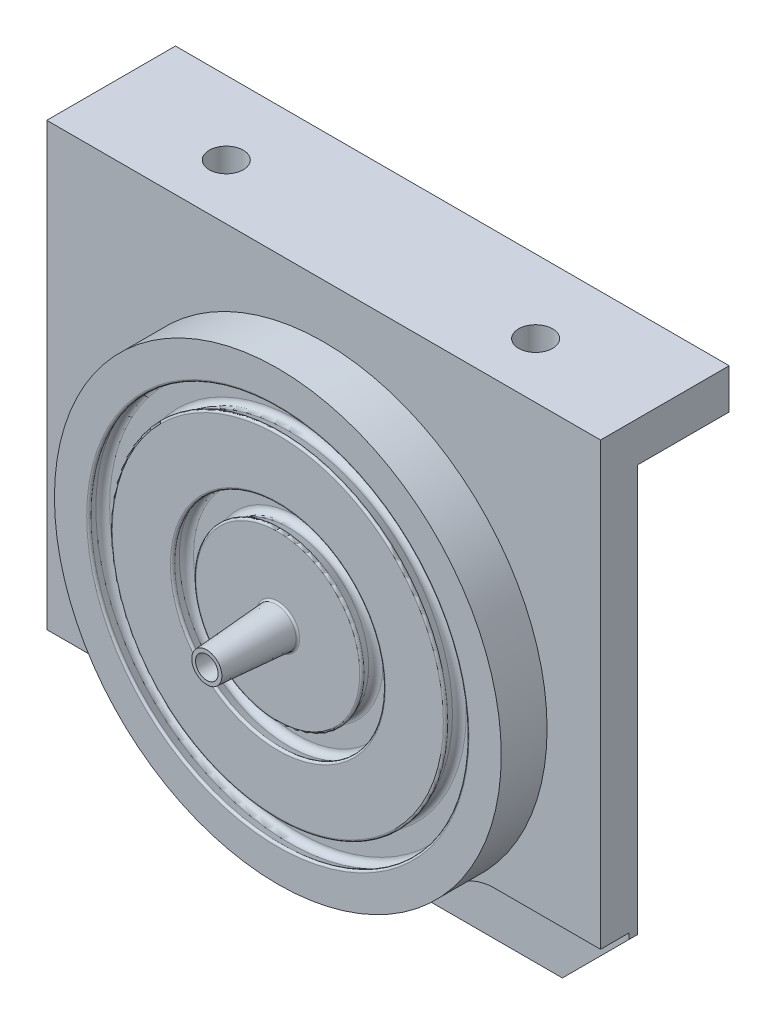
ISO-10303-21;
HEADER;
FILE_DESCRIPTION(('STEP AP214'),'2;1');
FILE_NAME('part.step','',(''),(''),'','','');
FILE_SCHEMA(('AUTOMOTIVE_DESIGN { 1 0 10303 214 1 1 1 1 }'));
ENDSEC;
DATA;
#1=APPLICATION_CONTEXT('core data for automotive mechanical design processes');
#2=APPLICATION_PROTOCOL_DEFINITION('international standard','automotive_design',2000,#1);
#3=PRODUCT_CONTEXT('',#1,'mechanical');
#4=PRODUCT('Part','Part','',(#3));
#5=PRODUCT_RELATED_PRODUCT_CATEGORY('part','',(#4));
#6=PRODUCT_DEFINITION_FORMATION('','',#4);
#7=PRODUCT_DEFINITION_CONTEXT('part definition',#1,'design');
#8=PRODUCT_DEFINITION('design','',#6,#7);
#9=PRODUCT_DEFINITION_SHAPE('','',#8);
#10=(LENGTH_UNIT() NAMED_UNIT(*) SI_UNIT(.MILLI.,.METRE.));
#11=(NAMED_UNIT(*) PLANE_ANGLE_UNIT() SI_UNIT($,.RADIAN.));
#12=(NAMED_UNIT(*) SI_UNIT($,.STERADIAN.) SOLID_ANGLE_UNIT());
#13=UNCERTAINTY_MEASURE_WITH_UNIT(LENGTH_MEASURE(1.E-05),#10,'distance_accuracy_value','');
#14=(GEOMETRIC_REPRESENTATION_CONTEXT(3) GLOBAL_UNCERTAINTY_ASSIGNED_CONTEXT((#13)) GLOBAL_UNIT_ASSIGNED_CONTEXT((#10,
#11,#12)) REPRESENTATION_CONTEXT('',''));
#15=CARTESIAN_POINT('',(0.,0.,0.));
#16=DIRECTION('',(0.,0.,1.));
#17=DIRECTION('',(1.,0.,0.));
#18=AXIS2_PLACEMENT_3D('',#15,#16,#17);
#19=CARTESIAN_POINT('',(0.,0.,17.78));
#20=DIRECTION('',(0.,0.,1.));
#21=DIRECTION('',(1.,0.,0.));
#22=AXIS2_PLACEMENT_3D('',#19,#20,#21);
#23=PLANE('',#22);
#24=CARTESIAN_POINT('',(0.,0.,17.78));
#25=DIRECTION('',(0.,0.,1.));
#26=DIRECTION('',(1.,0.,0.));
#27=AXIS2_PLACEMENT_3D('',#24,#25,#26);
#28=CIRCLE('',#27,12.7127);
#29=CARTESIAN_POINT('',(12.7127,0.,17.78));
#30=VERTEX_POINT('',#29);
#31=EDGE_CURVE('E47',#30,#30,#28,.F.);
#32=ORIENTED_EDGE('',*,*,#31,.T.);
#33=EDGE_LOOP('',(#32));
#34=FACE_BOUND('',#33,.T.);
#35=CARTESIAN_POINT('',(0.,0.,17.78));
#36=DIRECTION('',(0.,0.,1.));
#37=DIRECTION('',(1.,0.,0.));
#38=AXIS2_PLACEMENT_3D('',#35,#36,#37);
#39=CIRCLE('',#38,14.859);
#40=CARTESIAN_POINT('',(14.859,0.,17.78));
#41=VERTEX_POINT('',#40);
#42=EDGE_CURVE('E249',#41,#41,#39,.T.);
#43=ORIENTED_EDGE('',*,*,#42,.T.);
#44=EDGE_LOOP('',(#43));
#45=FACE_BOUND('',#44,.T.);
#46=ADVANCED_FACE('F39',(#34,#45),#23,.T.);
#47=CARTESIAN_POINT('',(0.,0.,17.78));
#48=DIRECTION('',(0.,0.,1.));
#49=DIRECTION('',(1.,0.,0.));
#50=AXIS2_PLACEMENT_3D('',#47,#48,#49);
#51=CIRCLE('',#50,11.0109);
#52=CARTESIAN_POINT('',(11.0109,0.,17.78));
#53=VERTEX_POINT('',#52);
#54=EDGE_CURVE('E433',#53,#53,#51,.T.);
#55=ORIENTED_EDGE('',*,*,#54,.T.);
#56=EDGE_LOOP('',(#55));
#57=FACE_BOUND('',#56,.T.);
#58=CARTESIAN_POINT('',(0.,0.,17.78));
#59=DIRECTION('',(0.,0.,1.));
#60=DIRECTION('',(1.,0.,0.));
#61=AXIS2_PLACEMENT_3D('',#58,#59,#60);
#62=CIRCLE('',#61,7.1501);
#63=CARTESIAN_POINT('',(7.1501,0.,17.78));
#64=VERTEX_POINT('',#63);
#65=EDGE_CURVE('E1037',#64,#64,#62,.F.);
#66=ORIENTED_EDGE('',*,*,#65,.T.);
#67=EDGE_LOOP('',(#66));
#68=FACE_BOUND('',#67,.T.);
#69=ADVANCED_FACE('F342',(#57,#68),#23,.T.);
#70=CARTESIAN_POINT('',(0.,0.,7.44460034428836));
#71=DIRECTION('',(0.,0.,-1.));
#72=DIRECTION('',(-1.,0.,0.));
#73=AXIS2_PLACEMENT_3D('',#70,#71,#72);
#74=PLANE('',#73);
#75=CARTESIAN_POINT('',(0.,0.,7.44460034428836));
#76=DIRECTION('',(0.,0.,-1.));
#77=DIRECTION('',(-1.,0.,0.));
#78=AXIS2_PLACEMENT_3D('',#75,#76,#77);
#79=CIRCLE('',#78,10.16);
#80=CARTESIAN_POINT('',(-10.16,0.,7.44460034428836));
#81=VERTEX_POINT('',#80);
#82=EDGE_CURVE('E191',#81,#81,#79,.T.);
#83=ORIENTED_EDGE('',*,*,#82,.T.);
#84=EDGE_LOOP('',(#83));
#85=FACE_BOUND('',#84,.T.);
#86=CARTESIAN_POINT('',(0.,0.,7.44460034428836));
#87=DIRECTION('',(0.,0.,-1.));
#88=DIRECTION('',(-1.,0.,0.));
#89=AXIS2_PLACEMENT_3D('',#86,#87,#88);
#90=CIRCLE('',#89,3.429);
#91=CARTESIAN_POINT('',(-3.429,0.,7.44460034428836));
#92=VERTEX_POINT('',#91);
#93=EDGE_CURVE('E187',#92,#92,#90,.T.);
#94=ORIENTED_EDGE('',*,*,#93,.F.);
#95=EDGE_LOOP('',(#94));
#96=FACE_BOUND('',#95,.T.);
#97=ADVANCED_FACE('F349',(#85,#96),#74,.T.);
#98=CARTESIAN_POINT('',(0.,0.,7.44460034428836));
#99=DIRECTION('',(0.,0.,-1.));
#100=DIRECTION('',(-1.,0.,0.));
#101=AXIS2_PLACEMENT_3D('',#98,#99,#100);
#102=CYLINDRICAL_SURFACE('',#101,2.70509999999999);
#103=CARTESIAN_POINT('',(0.,0.,16.1568003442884));
#104=DIRECTION('',(0.,0.,1.));
#105=DIRECTION('',(1.,0.,0.));
#106=AXIS2_PLACEMENT_3D('',#103,#104,#105);
#107=CIRCLE('',#106,2.70509999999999);
#108=CARTESIAN_POINT('',(2.70509999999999,0.,16.1568003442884));
#109=VERTEX_POINT('',#108);
#110=EDGE_CURVE('E425',#109,#109,#107,.T.);
#111=ORIENTED_EDGE('',*,*,#110,.T.);
#112=EDGE_LOOP('',(#111));
#113=FACE_BOUND('',#112,.T.);
#114=CARTESIAN_POINT('',(0.,0.,8.16850034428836));
#115=DIRECTION('',(0.,0.,-1.));
#116=DIRECTION('',(-1.,0.,0.));
#117=AXIS2_PLACEMENT_3D('',#114,#115,#116);
#118=CIRCLE('',#117,2.70509999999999);
#119=CARTESIAN_POINT('',(-2.70509999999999,0.,8.16850034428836));
#120=VERTEX_POINT('',#119);
#121=EDGE_CURVE('E190',#120,#120,#118,.F.);
#122=ORIENTED_EDGE('',*,*,#121,.F.);
#123=EDGE_LOOP('',(#122));
#124=FACE_BOUND('',#123,.T.);
#125=ADVANCED_FACE('F572',(#113,#124),#102,.F.);
#126=CARTESIAN_POINT('',(18.415,-11.303,16.764));
#127=DIRECTION('',(-0.707106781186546,0.707106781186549,0.));
#128=DIRECTION('',(-0.707106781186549,-0.707106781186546,0.));
#129=AXIS2_PLACEMENT_3D('',#126,#127,#128);
#130=PLANE('',#129);
#131=DIRECTION('',(0.577350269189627,0.577350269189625,0.577350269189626));
#132=VECTOR('',#131,1.);
#133=CARTESIAN_POINT('',(19.9127998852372,-9.80520011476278,13.7684002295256));
#134=LINE('',#133,#132);
#135=CARTESIAN_POINT('',(18.415,-11.303,12.2706003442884));
#136=VERTEX_POINT('',#135);
#137=CARTESIAN_POINT('',(13.97,-15.748,7.82560034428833));
#138=VERTEX_POINT('',#137);
#139=EDGE_CURVE('E54',#136,#138,#134,.F.);
#140=ORIENTED_EDGE('',*,*,#139,.F.);
#141=DIRECTION('',(0.,0.,-1.));
#142=VECTOR('',#141,1.);
#143=CARTESIAN_POINT('',(18.415,-11.303,16.764));
#144=LINE('',#143,#142);
#145=CARTESIAN_POINT('',(18.415,-11.303,12.827));
#146=VERTEX_POINT('',#145);
#147=EDGE_CURVE('E182',#146,#136,#144,.T.);
#148=ORIENTED_EDGE('',*,*,#147,.F.);
#149=DIRECTION('',(0.707106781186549,0.707106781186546,0.));
#150=VECTOR('',#149,1.);
#151=CARTESIAN_POINT('',(18.415,-11.303,12.827));
#152=LINE('',#151,#150);
#153=CARTESIAN_POINT('',(13.97,-15.748,12.827));
#154=VERTEX_POINT('',#153);
#155=EDGE_CURVE('E223',#146,#154,#152,.F.);
#156=ORIENTED_EDGE('',*,*,#155,.T.);
#157=DIRECTION('',(0.,0.,1.));
#158=VECTOR('',#157,1.);
#159=CARTESIAN_POINT('',(13.97,-15.748,16.764));
#160=LINE('',#159,#158);
#161=EDGE_CURVE('E61',#154,#138,#160,.F.);
#162=ORIENTED_EDGE('',*,*,#161,.T.);
#163=EDGE_LOOP('',(#140,#148,#156,#162));
#164=FACE_BOUND('',#163,.T.);
#165=ADVANCED_FACE('F570',(#164),#130,.F.);
#166=CARTESIAN_POINT('',(-11.303,-18.415,16.764));
#167=DIRECTION('',(0.707106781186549,0.707106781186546,0.));
#168=DIRECTION('',(-0.707106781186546,0.707106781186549,0.));
#169=AXIS2_PLACEMENT_3D('',#166,#167,#168);
#170=PLANE('',#169);
#171=DIRECTION('',(0.707106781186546,-0.707106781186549,0.));
#172=VECTOR('',#171,1.);
#173=CARTESIAN_POINT('',(-11.303,-18.415,6.17460034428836));
#174=LINE('',#173,#172);
#175=CARTESIAN_POINT('',(-13.97,-15.748,6.17460034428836));
#176=VERTEX_POINT('',#175);
#177=CARTESIAN_POINT('',(-18.415,-11.303,6.17460034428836));
#178=VERTEX_POINT('',#177);
#179=EDGE_CURVE('E278',#176,#178,#174,.F.);
#180=ORIENTED_EDGE('',*,*,#179,.F.);
#181=DIRECTION('',(0.,0.,-1.));
#182=VECTOR('',#181,1.);
#183=CARTESIAN_POINT('',(-13.97,-15.748,16.764));
#184=LINE('',#183,#182);
#185=CARTESIAN_POINT('',(-13.97,-15.748,12.827));
#186=VERTEX_POINT('',#185);
#187=EDGE_CURVE('E201',#176,#186,#184,.F.);
#188=ORIENTED_EDGE('',*,*,#187,.T.);
#189=DIRECTION('',(0.707106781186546,-0.707106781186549,0.));
#190=VECTOR('',#189,1.);
#191=CARTESIAN_POINT('',(-11.303,-18.415,12.827));
#192=LINE('',#191,#190);
#193=CARTESIAN_POINT('',(-18.415,-11.303,12.827));
#194=VERTEX_POINT('',#193);
#195=EDGE_CURVE('E218',#186,#194,#192,.F.);
#196=ORIENTED_EDGE('',*,*,#195,.T.);
#197=DIRECTION('',(0.,0.,1.));
#198=VECTOR('',#197,1.);
#199=CARTESIAN_POINT('',(-18.415,-11.303,16.764));
#200=LINE('',#199,#198);
#201=EDGE_CURVE('E298',#178,#194,#200,.T.);
#202=ORIENTED_EDGE('',*,*,#201,.F.);
#203=EDGE_LOOP('',(#180,#188,#196,#202));
#204=FACE_BOUND('',#203,.T.);
#205=ADVANCED_FACE('F468',(#204),#170,.F.);
#206=CARTESIAN_POINT('',(0.,0.,12.827));
#207=DIRECTION('',(0.,0.,1.));
#208=DIRECTION('',(1.,0.,0.));
#209=AXIS2_PLACEMENT_3D('',#206,#207,#208);
#210=PLANE('',#209);
#211=ORIENTED_EDGE('',*,*,#195,.F.);
#212=DIRECTION('',(1.,0.,0.));
#213=VECTOR('',#212,1.);
#214=CARTESIAN_POINT('',(0.,-15.748,12.827));
#215=LINE('',#214,#213);
#216=EDGE_CURVE('E416',#186,#154,#215,.T.);
#217=ORIENTED_EDGE('',*,*,#216,.T.);
#218=ORIENTED_EDGE('',*,*,#155,.F.);
#219=DIRECTION('',(0.,1.,0.));
#220=VECTOR('',#219,1.);
#221=CARTESIAN_POINT('',(18.415,18.415,12.827));
#222=LINE('',#221,#220);
#223=CARTESIAN_POINT('',(18.415,-10.922,12.827));
#224=VERTEX_POINT('',#223);
#225=EDGE_CURVE('E226',#146,#224,#222,.T.);
#226=ORIENTED_EDGE('',*,*,#225,.T.);
#227=DIRECTION('',(-1.,0.,0.));
#228=VECTOR('',#227,1.);
#229=CARTESIAN_POINT('',(10.0747107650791,-10.922,12.827));
#230=LINE('',#229,#228);
#231=CARTESIAN_POINT('',(11.3797952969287,-10.922,12.827));
#232=VERTEX_POINT('',#231);
#233=EDGE_CURVE('E209',#224,#232,#230,.T.);
#234=ORIENTED_EDGE('',*,*,#233,.T.);
#235=CARTESIAN_POINT('',(11.3797952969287,-14.478,12.827));
#236=DIRECTION('',(0.,0.,1.));
#237=DIRECTION('',(1.,0.,0.));
#238=AXIS2_PLACEMENT_3D('',#235,#236,#237);
#239=CIRCLE('',#238,3.556);
#240=CARTESIAN_POINT('',(9.18231758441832,-11.6822482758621,12.827));
#241=VERTEX_POINT('',#240);
#242=EDGE_CURVE('E406',#232,#241,#239,.T.);
#243=ORIENTED_EDGE('',*,*,#242,.T.);
#244=CARTESIAN_POINT('',(0.,0.,12.827));
#245=DIRECTION('',(0.,0.,-1.));
#246=DIRECTION('',(1.,0.,0.));
#247=AXIS2_PLACEMENT_3D('',#244,#245,#246);
#248=CIRCLE('',#247,14.859);
#249=CARTESIAN_POINT('',(-9.18231758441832,-11.6822482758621,12.827));
#250=VERTEX_POINT('',#249);
#251=EDGE_CURVE('E212',#241,#250,#248,.T.);
#252=ORIENTED_EDGE('',*,*,#251,.T.);
#253=CARTESIAN_POINT('',(-11.3797952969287,-14.478,12.827));
#254=DIRECTION('',(0.,0.,1.));
#255=DIRECTION('',(1.,0.,0.));
#256=AXIS2_PLACEMENT_3D('',#253,#254,#255);
#257=CIRCLE('',#256,3.556);
#258=CARTESIAN_POINT('',(-11.3797952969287,-10.922,12.827));
#259=VERTEX_POINT('',#258);
#260=EDGE_CURVE('E404',#250,#259,#257,.T.);
#261=ORIENTED_EDGE('',*,*,#260,.T.);
#262=DIRECTION('',(-1.,0.,0.));
#263=VECTOR('',#262,1.);
#264=CARTESIAN_POINT('',(-28.0861261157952,-10.922,12.827));
#265=LINE('',#264,#263);
#266=CARTESIAN_POINT('',(-18.415,-10.922,12.827));
#267=VERTEX_POINT('',#266);
#268=EDGE_CURVE('E216',#259,#267,#265,.T.);
#269=ORIENTED_EDGE('',*,*,#268,.T.);
#270=DIRECTION('',(0.,-1.,0.));
#271=VECTOR('',#270,1.);
#272=CARTESIAN_POINT('',(-18.415,18.415,12.827));
#273=LINE('',#272,#271);
#274=EDGE_CURVE('E388',#267,#194,#273,.T.);
#275=ORIENTED_EDGE('',*,*,#274,.T.);
#276=EDGE_LOOP('',(#211,#217,#218,#226,#234,#243,#252,#261,#269,#275));
#277=FACE_BOUND('',#276,.T.);
#278=ADVANCED_FACE('F471',(#277),#210,.T.);
#279=CARTESIAN_POINT('',(0.,0.,15.494));
#280=DIRECTION('',(0.,0.,1.));
#281=DIRECTION('',(1.,0.,0.));
#282=AXIS2_PLACEMENT_3D('',#279,#280,#281);
#283=CYLINDRICAL_SURFACE('',#282,14.859);
#284=CARTESIAN_POINT('',(0.,0.,14.732));
#285=DIRECTION('',(0.,0.,1.));
#286=DIRECTION('',(1.,0.,0.));
#287=AXIS2_PLACEMENT_3D('',#284,#285,#286);
#288=CIRCLE('',#287,14.859);
#289=CARTESIAN_POINT('',(9.18231758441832,-11.6822482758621,14.732));
#290=VERTEX_POINT('',#289);
#291=CARTESIAN_POINT('',(-9.18231758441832,-11.6822482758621,14.732));
#292=VERTEX_POINT('',#291);
#293=EDGE_CURVE('E228',#290,#292,#288,.T.);
#294=ORIENTED_EDGE('',*,*,#293,.T.);
#295=DIRECTION('',(0.,0.,1.));
#296=VECTOR('',#295,1.);
#297=CARTESIAN_POINT('',(-9.18231758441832,-11.6822482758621,15.494));
#298=LINE('',#297,#296);
#299=EDGE_CURVE('E397',#292,#250,#298,.F.);
#300=ORIENTED_EDGE('',*,*,#299,.T.);
#301=ORIENTED_EDGE('',*,*,#251,.F.);
#302=DIRECTION('',(0.,0.,1.));
#303=VECTOR('',#302,1.);
#304=CARTESIAN_POINT('',(9.18231758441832,-11.6822482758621,15.494));
#305=LINE('',#304,#303);
#306=EDGE_CURVE('E399',#241,#290,#305,.T.);
#307=ORIENTED_EDGE('',*,*,#306,.T.);
#308=EDGE_LOOP('',(#294,#300,#301,#307));
#309=FACE_BOUND('',#308,.T.);
#310=ORIENTED_EDGE('',*,*,#42,.F.);
#311=EDGE_LOOP('',(#310));
#312=FACE_BOUND('',#311,.T.);
#313=ADVANCED_FACE('F500',(#309,#312),#283,.T.);
#314=CARTESIAN_POINT('',(0.,0.,16.891));
#315=DIRECTION('',(0.,0.,-1.));
#316=DIRECTION('',(-1.,0.,0.));
#317=AXIS2_PLACEMENT_3D('',#314,#315,#316);
#318=TOROIDAL_SURFACE('',#317,5.69291473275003,0.4064);
#319=CARTESIAN_POINT('',(0.,0.,17.056297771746));
#320=DIRECTION('',(0.,0.,-1.));
#321=DIRECTION('',(-1.,0.,0.));
#322=AXIS2_PLACEMENT_3D('',#319,#320,#321);
#323=CIRCLE('',#322,5.32164985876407);
#324=CARTESIAN_POINT('',(-5.32164985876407,0.,17.056297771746));
#325=VERTEX_POINT('',#324);
#326=EDGE_CURVE('E237',#325,#325,#323,.T.);
#327=ORIENTED_EDGE('',*,*,#326,.T.);
#328=EDGE_LOOP('',(#327));
#329=FACE_BOUND('',#328,.T.);
#330=CARTESIAN_POINT('',(0.,0.,16.4846));
#331=DIRECTION('',(0.,0.,-1.));
#332=DIRECTION('',(-1.,0.,0.));
#333=AXIS2_PLACEMENT_3D('',#330,#331,#332);
#334=CIRCLE('',#333,5.69291473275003);
#335=CARTESIAN_POINT('',(-5.69291473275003,0.,16.4846));
#336=VERTEX_POINT('',#335);
#337=EDGE_CURVE('E246',#336,#336,#334,.T.);
#338=ORIENTED_EDGE('',*,*,#337,.F.);
#339=EDGE_LOOP('',(#338));
#340=FACE_BOUND('',#339,.T.);
#341=ADVANCED_FACE('F539',(#329,#340),#318,.F.);
#342=CARTESIAN_POINT('',(5.69291473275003,0.,16.4846));
#343=DIRECTION('',(0.,0.,1.));
#344=DIRECTION('',(1.,0.,0.));
#345=AXIS2_PLACEMENT_3D('',#342,#343,#344);
#346=PLANE('',#345);
#347=ORIENTED_EDGE('',*,*,#337,.T.);
#348=EDGE_LOOP('',(#347));
#349=FACE_BOUND('',#348,.T.);
#350=CARTESIAN_POINT('',(0.,0.,16.4846));
#351=DIRECTION('',(0.,0.,-1.));
#352=DIRECTION('',(-1.,0.,0.));
#353=AXIS2_PLACEMENT_3D('',#350,#351,#352);
#354=CIRCLE('',#353,6.90548526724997);
#355=CARTESIAN_POINT('',(-6.90548526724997,0.,16.4846));
#356=VERTEX_POINT('',#355);
#357=EDGE_CURVE('E243',#356,#356,#354,.T.);
#358=ORIENTED_EDGE('',*,*,#357,.F.);
#359=EDGE_LOOP('',(#358));
#360=FACE_BOUND('',#359,.T.);
#361=ADVANCED_FACE('F536',(#349,#360),#346,.T.);
#362=CARTESIAN_POINT('',(0.,0.,16.891));
#363=DIRECTION('',(0.,0.,-1.));
#364=DIRECTION('',(-1.,0.,0.));
#365=AXIS2_PLACEMENT_3D('',#362,#363,#364);
#366=TOROIDAL_SURFACE('',#365,6.90548526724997,0.4064);
#367=ORIENTED_EDGE('',*,*,#357,.T.);
#368=EDGE_LOOP('',(#367));
#369=FACE_BOUND('',#368,.T.);
#370=CARTESIAN_POINT('',(0.,0.,17.056297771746));
#371=DIRECTION('',(0.,0.,-1.));
#372=DIRECTION('',(-1.,0.,0.));
#373=AXIS2_PLACEMENT_3D('',#370,#371,#372);
#374=CIRCLE('',#373,7.27675014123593);
#375=CARTESIAN_POINT('',(-7.27675014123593,0.,17.056297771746));
#376=VERTEX_POINT('',#375);
#377=EDGE_CURVE('E240',#376,#376,#374,.T.);
#378=ORIENTED_EDGE('',*,*,#377,.F.);
#379=EDGE_LOOP('',(#378));
#380=FACE_BOUND('',#379,.T.);
#381=ADVANCED_FACE('F532',(#369,#380),#366,.F.);
#382=CARTESIAN_POINT('',(0.,0.,17.78));
#383=DIRECTION('',(0.,0.,-1.));
#384=DIRECTION('',(-1.,0.,0.));
#385=AXIS2_PLACEMENT_3D('',#382,#383,#384);
#386=CONICAL_SURFACE('',#385,6.95453714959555,0.418879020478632);
#387=CARTESIAN_POINT('',(0.,0.,17.6013444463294));
#388=DIRECTION('',(0.,0.,1.));
#389=DIRECTION('',(1.,0.,0.));
#390=AXIS2_PLACEMENT_3D('',#387,#388,#389);
#391=CIRCLE('',#390,7.03407972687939);
#392=CARTESIAN_POINT('',(7.03407972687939,0.,17.6013444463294));
#393=VERTEX_POINT('',#392);
#394=EDGE_CURVE('E383',#393,#393,#391,.T.);
#395=ORIENTED_EDGE('',*,*,#394,.T.);
#396=EDGE_LOOP('',(#395));
#397=FACE_BOUND('',#396,.T.);
#398=ORIENTED_EDGE('',*,*,#377,.T.);
#399=EDGE_LOOP('',(#398));
#400=FACE_BOUND('',#399,.T.);
#401=ADVANCED_FACE('F528',(#397,#400),#386,.F.);
#402=CARTESIAN_POINT('',(0.,0.,17.056297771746));
#403=DIRECTION('',(0.,0.,1.));
#404=DIRECTION('',(1.,0.,0.));
#405=AXIS2_PLACEMENT_3D('',#402,#403,#404);
#406=CONICAL_SURFACE('',#405,5.32164985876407,0.418879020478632);
#407=CARTESIAN_POINT('',(0.,0.,17.6013444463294));
#408=DIRECTION('',(0.,0.,-1.));
#409=DIRECTION('',(-1.,0.,0.));
#410=AXIS2_PLACEMENT_3D('',#407,#408,#409);
#411=CIRCLE('',#410,5.56432027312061);
#412=CARTESIAN_POINT('',(-5.56432027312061,0.,17.6013444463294));
#413=VERTEX_POINT('',#412);
#414=EDGE_CURVE('E378',#413,#413,#411,.T.);
#415=ORIENTED_EDGE('',*,*,#414,.T.);
#416=EDGE_LOOP('',(#415));
#417=FACE_BOUND('',#416,.T.);
#418=ORIENTED_EDGE('',*,*,#326,.F.);
#419=EDGE_LOOP('',(#418));
#420=FACE_BOUND('',#419,.T.);
#421=ADVANCED_FACE('F524',(#417,#420),#406,.T.);
#422=CARTESIAN_POINT('',(0.,0.,13.6144));
#423=DIRECTION('',(0.,0.,1.));
#424=DIRECTION('',(1.,0.,0.));
#425=AXIS2_PLACEMENT_3D('',#422,#423,#424);
#426=CYLINDRICAL_SURFACE('',#425,0.75057);
#427=CARTESIAN_POINT('',(0.,0.,16.3346003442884));
#428=DIRECTION('',(0.,0.,1.));
#429=DIRECTION('',(1.,0.,0.));
#430=AXIS2_PLACEMENT_3D('',#427,#428,#429);
#431=CIRCLE('',#430,0.75057);
#432=CARTESIAN_POINT('',(0.75057,0.,16.3346003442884));
#433=VERTEX_POINT('',#432);
#434=EDGE_CURVE('E198',#433,#433,#431,.F.);
#435=ORIENTED_EDGE('',*,*,#434,.T.);
#436=EDGE_LOOP('',(#435));
#437=FACE_BOUND('',#436,.T.);
#438=CARTESIAN_POINT('',(0.,0.,22.5044));
#439=DIRECTION('',(0.,0.,1.));
#440=DIRECTION('',(1.,0.,0.));
#441=AXIS2_PLACEMENT_3D('',#438,#439,#440);
#442=CIRCLE('',#441,0.75057);
#443=CARTESIAN_POINT('',(0.75057,0.,22.5044));
#444=VERTEX_POINT('',#443);
#445=EDGE_CURVE('E288',#444,#444,#442,.T.);
#446=ORIENTED_EDGE('',*,*,#445,.T.);
#447=EDGE_LOOP('',(#446));
#448=FACE_BOUND('',#447,.T.);
#449=ADVANCED_FACE('F527',(#437,#448),#426,.F.);
#450=CARTESIAN_POINT('',(0.,0.,22.5044));
#451=DIRECTION('',(0.,0.,1.));
#452=DIRECTION('',(1.,0.,0.));
#453=AXIS2_PLACEMENT_3D('',#450,#451,#452);
#454=PLANE('',#453);
#455=ORIENTED_EDGE('',*,*,#445,.F.);
#456=EDGE_LOOP('',(#455));
#457=FACE_BOUND('',#456,.T.);
#458=CARTESIAN_POINT('',(0.,0.,22.5044));
#459=DIRECTION('',(0.,0.,1.));
#460=DIRECTION('',(1.,0.,0.));
#461=AXIS2_PLACEMENT_3D('',#458,#459,#460);
#462=CIRCLE('',#461,1.00313776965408);
#463=CARTESIAN_POINT('',(1.00313776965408,0.,22.5044));
#464=VERTEX_POINT('',#463);
#465=EDGE_CURVE('E291',#464,#464,#462,.T.);
#466=ORIENTED_EDGE('',*,*,#465,.T.);
#467=EDGE_LOOP('',(#466));
#468=FACE_BOUND('',#467,.T.);
#469=ADVANCED_FACE('F366',(#457,#468),#454,.T.);
#470=CARTESIAN_POINT('',(0.,0.,17.78));
#471=DIRECTION('',(0.,0.,-1.));
#472=DIRECTION('',(1.,0.,0.));
#473=AXIS2_PLACEMENT_3D('',#470,#471,#472);
#474=CONICAL_SURFACE('',#473,1.3335,0.0698131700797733);
#475=CARTESIAN_POINT('',(0.,0.,17.8981409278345));
#476=DIRECTION('',(0.,0.,1.));
#477=DIRECTION('',(1.,0.,0.));
#478=AXIS2_PLACEMENT_3D('',#475,#476,#477);
#479=CIRCLE('',#478,1.32523878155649);
#480=CARTESIAN_POINT('',(1.32523878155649,0.,17.8981409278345));
#481=VERTEX_POINT('',#480);
#482=EDGE_CURVE('E377',#481,#481,#479,.T.);
#483=ORIENTED_EDGE('',*,*,#482,.T.);
#484=EDGE_LOOP('',(#483));
#485=FACE_BOUND('',#484,.T.);
#486=ORIENTED_EDGE('',*,*,#465,.F.);
#487=EDGE_LOOP('',(#486));
#488=FACE_BOUND('',#487,.T.);
#489=ADVANCED_FACE('F357',(#485,#488),#474,.T.);
#490=CARTESIAN_POINT('',(0.,0.,17.78));
#491=DIRECTION('',(0.,0.,1.));
#492=DIRECTION('',(1.,0.,0.));
#493=AXIS2_PLACEMENT_3D('',#490,#491,#492);
#494=CIRCLE('',#493,1.45192941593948);
#495=CARTESIAN_POINT('',(1.45192941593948,0.,17.78));
#496=VERTEX_POINT('',#495);
#497=EDGE_CURVE('E372',#496,#496,#494,.F.);
#498=ORIENTED_EDGE('',*,*,#497,.T.);
#499=EDGE_LOOP('',(#498));
#500=FACE_BOUND('',#499,.T.);
#501=CARTESIAN_POINT('',(0.,0.,17.78));
#502=DIRECTION('',(0.,0.,1.));
#503=DIRECTION('',(1.,0.,0.));
#504=AXIS2_PLACEMENT_3D('',#501,#502,#503);
#505=CIRCLE('',#504,5.4483);
#506=CARTESIAN_POINT('',(5.4483,0.,17.78));
#507=VERTEX_POINT('',#506);
#508=EDGE_CURVE('E375',#507,#507,#505,.T.);
#509=ORIENTED_EDGE('',*,*,#508,.T.);
#510=EDGE_LOOP('',(#509));
#511=FACE_BOUND('',#510,.T.);
#512=ADVANCED_FACE('F345',(#500,#511),#23,.T.);
#513=CARTESIAN_POINT('',(0.,0.,17.653));
#514=DIRECTION('',(0.,0.,1.));
#515=DIRECTION('',(1.,0.,0.));
#516=AXIS2_PLACEMENT_3D('',#513,#514,#515);
#517=TOROIDAL_SURFACE('',#516,7.1501,0.127);
#518=ORIENTED_EDGE('',*,*,#394,.F.);
#519=EDGE_LOOP('',(#518));
#520=FACE_BOUND('',#519,.T.);
#521=ORIENTED_EDGE('',*,*,#65,.F.);
#522=EDGE_LOOP('',(#521));
#523=FACE_BOUND('',#522,.T.);
#524=ADVANCED_FACE('F356',(#520,#523),#517,.T.);
#525=CARTESIAN_POINT('',(0.,0.,17.653));
#526=DIRECTION('',(0.,0.,1.));
#527=DIRECTION('',(1.,0.,0.));
#528=AXIS2_PLACEMENT_3D('',#525,#526,#527);
#529=TOROIDAL_SURFACE('',#528,5.4483,0.127);
#530=ORIENTED_EDGE('',*,*,#508,.F.);
#531=EDGE_LOOP('',(#530));
#532=FACE_BOUND('',#531,.T.);
#533=ORIENTED_EDGE('',*,*,#414,.F.);
#534=EDGE_LOOP('',(#533));
#535=FACE_BOUND('',#534,.T.);
#536=ADVANCED_FACE('F363',(#532,#535),#529,.T.);
#537=CARTESIAN_POINT('',(0.,0.,17.907));
#538=DIRECTION('',(0.,0.,1.));
#539=DIRECTION('',(1.,0.,0.));
#540=AXIS2_PLACEMENT_3D('',#537,#538,#539);
#541=TOROIDAL_SURFACE('',#540,1.45192941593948,0.127);
#542=ORIENTED_EDGE('',*,*,#497,.F.);
#543=EDGE_LOOP('',(#542));
#544=FACE_BOUND('',#543,.T.);
#545=ORIENTED_EDGE('',*,*,#482,.F.);
#546=EDGE_LOOP('',(#545));
#547=FACE_BOUND('',#546,.T.);
#548=ADVANCED_FACE('F523',(#544,#547),#541,.F.);
#549=CARTESIAN_POINT('',(18.415,18.415,14.732));
#550=DIRECTION('',(0.,0.,1.));
#551=DIRECTION('',(1.,0.,0.));
#552=AXIS2_PLACEMENT_3D('',#549,#550,#551);
#553=PLANE('',#552);
#554=CARTESIAN_POINT('',(-11.3797952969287,-14.478,14.732));
#555=DIRECTION('',(0.,0.,1.));
#556=DIRECTION('',(1.,0.,0.));
#557=AXIS2_PLACEMENT_3D('',#554,#555,#556);
#558=CIRCLE('',#557,3.556);
#559=CARTESIAN_POINT('',(-11.3797952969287,-10.922,14.732));
#560=VERTEX_POINT('',#559);
#561=EDGE_CURVE('E413',#560,#292,#558,.F.);
#562=ORIENTED_EDGE('',*,*,#561,.T.);
#563=ORIENTED_EDGE('',*,*,#293,.F.);
#564=CARTESIAN_POINT('',(11.3797952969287,-14.478,14.732));
#565=DIRECTION('',(0.,0.,1.));
#566=DIRECTION('',(1.,0.,0.));
#567=AXIS2_PLACEMENT_3D('',#564,#565,#566);
#568=CIRCLE('',#567,3.556);
#569=CARTESIAN_POINT('',(11.3797952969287,-10.922,14.732));
#570=VERTEX_POINT('',#569);
#571=EDGE_CURVE('E411',#290,#570,#568,.F.);
#572=ORIENTED_EDGE('',*,*,#571,.T.);
#573=DIRECTION('',(-1.,0.,0.));
#574=VECTOR('',#573,1.);
#575=CARTESIAN_POINT('',(10.0747107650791,-10.922,14.732));
#576=LINE('',#575,#574);
#577=CARTESIAN_POINT('',(18.415,-10.922,14.732));
#578=VERTEX_POINT('',#577);
#579=EDGE_CURVE('E208',#578,#570,#576,.T.);
#580=ORIENTED_EDGE('',*,*,#579,.F.);
#581=DIRECTION('',(0.,1.,0.));
#582=VECTOR('',#581,1.);
#583=CARTESIAN_POINT('',(18.415,-18.415,14.732));
#584=LINE('',#583,#582);
#585=CARTESIAN_POINT('',(18.415,18.415,14.732));
#586=VERTEX_POINT('',#585);
#587=EDGE_CURVE('E230',#578,#586,#584,.T.);
#588=ORIENTED_EDGE('',*,*,#587,.T.);
#589=DIRECTION('',(-1.,0.,0.));
#590=VECTOR('',#589,1.);
#591=CARTESIAN_POINT('',(18.415,18.415,14.732));
#592=LINE('',#591,#590);
#593=CARTESIAN_POINT('',(-18.415,18.415,14.732));
#594=VERTEX_POINT('',#593);
#595=EDGE_CURVE('E232',#586,#594,#592,.T.);
#596=ORIENTED_EDGE('',*,*,#595,.T.);
#597=DIRECTION('',(0.,-1.,0.));
#598=VECTOR('',#597,1.);
#599=CARTESIAN_POINT('',(-18.415,18.415,14.732));
#600=LINE('',#599,#598);
#601=CARTESIAN_POINT('',(-18.415,-10.922,14.732));
#602=VERTEX_POINT('',#601);
#603=EDGE_CURVE('E234',#594,#602,#600,.T.);
#604=ORIENTED_EDGE('',*,*,#603,.T.);
#605=DIRECTION('',(-1.,0.,0.));
#606=VECTOR('',#605,1.);
#607=CARTESIAN_POINT('',(-28.0861261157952,-10.922,14.732));
#608=LINE('',#607,#606);
#609=EDGE_CURVE('E213',#560,#602,#608,.T.);
#610=ORIENTED_EDGE('',*,*,#609,.F.);
#611=EDGE_LOOP('',(#562,#563,#572,#580,#588,#596,#604,#610));
#612=FACE_BOUND('',#611,.T.);
#613=ADVANCED_FACE('F487',(#612),#553,.T.);
#614=CARTESIAN_POINT('',(-8.255,-12.954,12.1436003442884));
#615=DIRECTION('',(0.,0.,-1.));
#616=DIRECTION('',(-1.,0.,0.));
#617=AXIS2_PLACEMENT_3D('',#614,#615,#616);
#618=CONICAL_SURFACE('',#617,1.1303,1.02974425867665);
#619=CARTESIAN_POINT('',(-8.255,-12.954,12.8227531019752));
#620=VERTEX_POINT('',#619);
#621=VERTEX_LOOP('',#620);
#622=FACE_BOUND('',#621,.T.);
#623=CARTESIAN_POINT('',(-8.255,-12.954,12.1436003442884));
#624=DIRECTION('',(0.,0.,-1.));
#625=DIRECTION('',(-1.,0.,0.));
#626=AXIS2_PLACEMENT_3D('',#623,#624,#625);
#627=CIRCLE('',#626,1.1303);
#628=CARTESIAN_POINT('',(-9.3853,-12.954,12.1436003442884));
#629=VERTEX_POINT('',#628);
#630=EDGE_CURVE('E258',#629,#629,#627,.T.);
#631=ORIENTED_EDGE('',*,*,#630,.T.);
#632=EDGE_LOOP('',(#631));
#633=FACE_BOUND('',#632,.T.);
#634=ADVANCED_FACE('F522',(#622,#633),#618,.F.);
#635=CARTESIAN_POINT('',(8.25500000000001,-12.954,12.1436003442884));
#636=DIRECTION('',(0.,0.,-1.));
#637=DIRECTION('',(-1.,0.,0.));
#638=AXIS2_PLACEMENT_3D('',#635,#636,#637);
#639=CONICAL_SURFACE('',#638,1.1303,1.02974425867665);
#640=CARTESIAN_POINT('',(8.255,-12.954,12.8227531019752));
#641=VERTEX_POINT('',#640);
#642=VERTEX_LOOP('',#641);
#643=FACE_BOUND('',#642,.T.);
#644=CARTESIAN_POINT('',(8.25500000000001,-12.954,12.1436003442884));
#645=DIRECTION('',(0.,0.,-1.));
#646=DIRECTION('',(-1.,0.,0.));
#647=AXIS2_PLACEMENT_3D('',#644,#645,#646);
#648=CIRCLE('',#647,1.1303);
#649=CARTESIAN_POINT('',(7.12470000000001,-12.954,12.1436003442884));
#650=VERTEX_POINT('',#649);
#651=EDGE_CURVE('E252',#650,#650,#648,.T.);
#652=ORIENTED_EDGE('',*,*,#651,.T.);
#653=EDGE_LOOP('',(#652));
#654=FACE_BOUND('',#653,.T.);
#655=ADVANCED_FACE('F926',(#643,#654),#639,.F.);
#656=CARTESIAN_POINT('',(-10.16,8.89,11.049));
#657=DIRECTION('',(0.,1.,0.));
#658=DIRECTION('',(0.,0.,1.));
#659=AXIS2_PLACEMENT_3D('',#656,#657,#658);
#660=CONICAL_SURFACE('',#659,1.1303,1.02974425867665);
#661=CARTESIAN_POINT('',(-10.16,8.21084724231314,11.049));
#662=VERTEX_POINT('',#661);
#663=VERTEX_LOOP('',#662);
#664=FACE_BOUND('',#663,.T.);
#665=CARTESIAN_POINT('',(-10.16,8.89,11.049));
#666=DIRECTION('',(0.,1.,0.));
#667=DIRECTION('',(0.,0.,1.));
#668=AXIS2_PLACEMENT_3D('',#665,#666,#667);
#669=CIRCLE('',#668,1.1303);
#670=CARTESIAN_POINT('',(-10.16,8.89,12.1793));
#671=VERTEX_POINT('',#670);
#672=EDGE_CURVE('E264',#671,#671,#669,.T.);
#673=ORIENTED_EDGE('',*,*,#672,.T.);
#674=EDGE_LOOP('',(#673));
#675=FACE_BOUND('',#674,.T.);
#676=ADVANCED_FACE('F932',(#664,#675),#660,.F.);
#677=CARTESIAN_POINT('',(-8.255,-12.954,6.17460034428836));
#678=DIRECTION('',(0.,0.,-1.));
#679=DIRECTION('',(-1.,0.,0.));
#680=AXIS2_PLACEMENT_3D('',#677,#678,#679);
#681=CYLINDRICAL_SURFACE('',#680,1.1303);
#682=ORIENTED_EDGE('',*,*,#630,.F.);
#683=EDGE_LOOP('',(#682));
#684=FACE_BOUND('',#683,.T.);
#685=CARTESIAN_POINT('',(-8.255,-12.954,6.17460034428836));
#686=DIRECTION('',(0.,0.,-1.));
#687=DIRECTION('',(-1.,0.,0.));
#688=AXIS2_PLACEMENT_3D('',#685,#686,#687);
#689=CIRCLE('',#688,1.1303);
#690=CARTESIAN_POINT('',(-9.3853,-12.954,6.17460034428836));
#691=VERTEX_POINT('',#690);
#692=EDGE_CURVE('E261',#691,#691,#689,.T.);
#693=ORIENTED_EDGE('',*,*,#692,.T.);
#694=EDGE_LOOP('',(#693));
#695=FACE_BOUND('',#694,.T.);
#696=ADVANCED_FACE('F336',(#684,#695),#681,.F.);
#697=CARTESIAN_POINT('',(8.25500000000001,-12.954,6.17460034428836));
#698=DIRECTION('',(0.,0.,-1.));
#699=DIRECTION('',(-1.,0.,0.));
#700=AXIS2_PLACEMENT_3D('',#697,#698,#699);
#701=CYLINDRICAL_SURFACE('',#700,1.1303);
#702=ORIENTED_EDGE('',*,*,#651,.F.);
#703=EDGE_LOOP('',(#702));
#704=FACE_BOUND('',#703,.T.);
#705=CARTESIAN_POINT('',(8.25500000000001,-12.954,6.17460034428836));
#706=DIRECTION('',(0.,0.,-1.));
#707=DIRECTION('',(-1.,0.,0.));
#708=AXIS2_PLACEMENT_3D('',#705,#706,#707);
#709=CIRCLE('',#708,1.1303);
#710=CARTESIAN_POINT('',(7.12470000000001,-12.954,6.17460034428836));
#711=VERTEX_POINT('',#710);
#712=EDGE_CURVE('E255',#711,#711,#709,.T.);
#713=ORIENTED_EDGE('',*,*,#712,.T.);
#714=EDGE_LOOP('',(#713));
#715=FACE_BOUND('',#714,.T.);
#716=ADVANCED_FACE('F329',(#704,#715),#701,.F.);
#717=CARTESIAN_POINT('',(-18.415,18.415,6.17460034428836));
#718=DIRECTION('',(0.,0.,1.));
#719=DIRECTION('',(1.,0.,0.));
#720=AXIS2_PLACEMENT_3D('',#717,#718,#719);
#721=PLANE('',#720);
#722=CARTESIAN_POINT('',(0.,0.,6.17460034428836));
#723=DIRECTION('',(0.,0.,-1.));
#724=DIRECTION('',(-1.,0.,0.));
#725=AXIS2_PLACEMENT_3D('',#722,#723,#724);
#726=CIRCLE('',#725,10.16);
#727=CARTESIAN_POINT('',(-10.16,0.,6.17460034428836));
#728=VERTEX_POINT('',#727);
#729=EDGE_CURVE('E195',#728,#728,#726,.T.);
#730=ORIENTED_EDGE('',*,*,#729,.F.);
#731=EDGE_LOOP('',(#730));
#732=FACE_BOUND('',#731,.T.);
#733=DIRECTION('',(0.,-1.,0.));
#734=VECTOR('',#733,1.);
#735=CARTESIAN_POINT('',(18.415,18.415,6.17460034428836));
#736=LINE('',#735,#734);
#737=CARTESIAN_POINT('',(18.415,18.415,6.17460034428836));
#738=VERTEX_POINT('',#737);
#739=CARTESIAN_POINT('',(18.415,15.748,6.17460034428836));
#740=VERTEX_POINT('',#739);
#741=EDGE_CURVE('E281',#738,#740,#736,.T.);
#742=ORIENTED_EDGE('',*,*,#741,.T.);
#743=DIRECTION('',(1.,0.,0.));
#744=VECTOR('',#743,1.);
#745=CARTESIAN_POINT('',(12.319,15.748,6.17460034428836));
#746=LINE('',#745,#744);
#747=CARTESIAN_POINT('',(12.319,15.748,6.17460034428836));
#748=VERTEX_POINT('',#747);
#749=EDGE_CURVE('E172',#748,#740,#746,.T.);
#750=ORIENTED_EDGE('',*,*,#749,.F.);
#751=DIRECTION('',(0.,-1.,0.));
#752=VECTOR('',#751,1.);
#753=CARTESIAN_POINT('',(12.319,24.3690458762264,6.17460034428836));
#754=LINE('',#753,#752);
#755=CARTESIAN_POINT('',(12.319,-15.748,6.17460034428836));
#756=VERTEX_POINT('',#755);
#757=EDGE_CURVE('E165',#748,#756,#754,.T.);
#758=ORIENTED_EDGE('',*,*,#757,.T.);
#759=DIRECTION('',(1.,0.,0.));
#760=VECTOR('',#759,1.);
#761=CARTESIAN_POINT('',(-18.415,-15.748,6.17460034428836));
#762=LINE('',#761,#760);
#763=EDGE_CURVE('E205',#176,#756,#762,.T.);
#764=ORIENTED_EDGE('',*,*,#763,.F.);
#765=ORIENTED_EDGE('',*,*,#179,.T.);
#766=DIRECTION('',(0.,-1.,0.));
#767=VECTOR('',#766,1.);
#768=CARTESIAN_POINT('',(-18.415,18.415,6.17460034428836));
#769=LINE('',#768,#767);
#770=CARTESIAN_POINT('',(-18.415,18.415,6.17460034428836));
#771=VERTEX_POINT('',#770);
#772=EDGE_CURVE('E283',#771,#178,#769,.T.);
#773=ORIENTED_EDGE('',*,*,#772,.F.);
#774=DIRECTION('',(1.,0.,0.));
#775=VECTOR('',#774,1.);
#776=CARTESIAN_POINT('',(-18.415,18.415,6.17460034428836));
#777=LINE('',#776,#775);
#778=EDGE_CURVE('E285',#771,#738,#777,.T.);
#779=ORIENTED_EDGE('',*,*,#778,.T.);
#780=EDGE_LOOP('',(#742,#750,#758,#764,#765,#773,#779));
#781=FACE_BOUND('',#780,.T.);
#782=ORIENTED_EDGE('',*,*,#692,.F.);
#783=EDGE_LOOP('',(#782));
#784=FACE_BOUND('',#783,.T.);
#785=ORIENTED_EDGE('',*,*,#712,.F.);
#786=EDGE_LOOP('',(#785));
#787=FACE_BOUND('',#786,.T.);
#788=ADVANCED_FACE('F327',(#732,#781,#784,#787),#721,.F.);
#789=CARTESIAN_POINT('',(-10.16,18.415,11.049));
#790=DIRECTION('',(0.,1.,0.));
#791=DIRECTION('',(0.,0.,1.));
#792=AXIS2_PLACEMENT_3D('',#789,#790,#791);
#793=CYLINDRICAL_SURFACE('',#792,1.13029999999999);
#794=ORIENTED_EDGE('',*,*,#672,.F.);
#795=EDGE_LOOP('',(#794));
#796=FACE_BOUND('',#795,.T.);
#797=CARTESIAN_POINT('',(-10.16,18.415,11.049));
#798=DIRECTION('',(0.,1.,0.));
#799=DIRECTION('',(0.,0.,1.));
#800=AXIS2_PLACEMENT_3D('',#797,#798,#799);
#801=CIRCLE('',#800,1.13029999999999);
#802=CARTESIAN_POINT('',(-10.16,18.415,12.1793));
#803=VERTEX_POINT('',#802);
#804=EDGE_CURVE('E267',#803,#803,#801,.T.);
#805=ORIENTED_EDGE('',*,*,#804,.T.);
#806=EDGE_LOOP('',(#805));
#807=FACE_BOUND('',#806,.T.);
#808=ADVANCED_FACE('F321',(#796,#807),#793,.F.);
#809=CARTESIAN_POINT('',(10.414,8.89,11.049));
#810=DIRECTION('',(0.,1.,0.));
#811=DIRECTION('',(0.,0.,1.));
#812=AXIS2_PLACEMENT_3D('',#809,#810,#811);
#813=CONICAL_SURFACE('',#812,1.1303,1.02974425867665);
#814=CARTESIAN_POINT('',(10.414,8.89,11.049));
#815=DIRECTION('',(0.,1.,0.));
#816=DIRECTION('',(0.,0.,1.));
#817=AXIS2_PLACEMENT_3D('',#814,#815,#816);
#818=CIRCLE('',#817,1.1303);
#819=CARTESIAN_POINT('',(9.63138220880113,8.89,10.2334710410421));
#820=VERTEX_POINT('',#819);
#821=CARTESIAN_POINT('',(10.3386919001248,8.89,12.1767884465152));
#822=VERTEX_POINT('',#821);
#823=EDGE_CURVE('E270',#820,#822,#818,.T.);
#824=ORIENTED_EDGE('',*,*,#823,.T.);
#825=CARTESIAN_POINT('',(9.63125776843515,8.8902,10.2331291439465));
#826=CARTESIAN_POINT('',(9.64681086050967,8.86522914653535,10.2758609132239));
#827=CARTESIAN_POINT('',(9.66239671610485,8.84042419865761,10.3186826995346));
#828=CARTESIAN_POINT('',(9.69369592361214,8.79139646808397,10.4046765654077));
#829=CARTESIAN_POINT('',(9.70940939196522,8.76717432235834,10.4478489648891));
#830=CARTESIAN_POINT('',(9.7416314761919,8.71865522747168,10.5363784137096));
#831=CARTESIAN_POINT('',(9.75814656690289,8.69439479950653,10.5817532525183));
#832=CARTESIAN_POINT('',(9.79143027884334,8.64743968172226,10.6731994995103));
#833=CARTESIAN_POINT('',(9.80819878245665,8.6247442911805,10.719270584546));
#834=CARTESIAN_POINT('',(9.83471100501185,8.59143168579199,10.7921123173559));
#835=CARTESIAN_POINT('',(9.84431446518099,8.57987838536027,10.8184976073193));
#836=CARTESIAN_POINT('',(9.86368265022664,8.55800063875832,10.871711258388));
#837=CARTESIAN_POINT('',(9.8734474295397,8.54767661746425,10.8985397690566));
#838=CARTESIAN_POINT('',(9.90280910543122,8.51952340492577,10.9792103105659));
#839=CARTESIAN_POINT('',(9.92272859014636,8.50416499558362,11.0339386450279));
#840=CARTESIAN_POINT('',(9.95115163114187,8.49117966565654,11.1120303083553));
#841=CARTESIAN_POINT('',(9.95937878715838,8.48844054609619,11.134634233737));
#842=CARTESIAN_POINT('',(9.97588456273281,8.48522935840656,11.1799834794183));
#843=CARTESIAN_POINT('',(9.98416316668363,8.48475663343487,11.2027287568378));
#844=CARTESIAN_POINT('',(10.0007167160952,8.48613128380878,11.2482092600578));
#845=CARTESIAN_POINT('',(10.0089916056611,8.48798419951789,11.2709443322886));
#846=CARTESIAN_POINT('',(10.0254519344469,8.49382178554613,11.3161687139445));
#847=CARTESIAN_POINT('',(10.0336373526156,8.4978069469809,11.3386579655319));
#848=CARTESIAN_POINT('',(10.0603406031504,8.51381667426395,11.4120245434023));
#849=CARTESIAN_POINT('',(10.0785897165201,8.52958530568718,11.4621635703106));
#850=CARTESIAN_POINT('',(10.1144847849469,8.56621458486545,11.5607844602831));
#851=CARTESIAN_POINT('',(10.1321286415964,8.58709123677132,11.6092605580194));
#852=CARTESIAN_POINT('',(10.1672120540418,8.63181548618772,11.7056514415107));
#853=CARTESIAN_POINT('',(10.1846467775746,8.65569509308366,11.7535529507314));
#854=CARTESIAN_POINT('',(10.2192239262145,8.70500056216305,11.8485528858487));
#855=CARTESIAN_POINT('',(10.2363667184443,8.73042426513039,11.8956523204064));
#856=CARTESIAN_POINT('',(10.2678481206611,8.77823123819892,11.9821467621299));
#857=CARTESIAN_POINT('',(10.2822111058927,8.80047802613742,12.0216087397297));
#858=CARTESIAN_POINT('',(10.310663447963,8.845172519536,12.0997809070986));
#859=CARTESIAN_POINT('',(10.3247539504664,8.86761397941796,12.1384942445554));
#860=CARTESIAN_POINT('',(10.3388163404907,8.8902,12.1771303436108));
#861=B_SPLINE_CURVE_WITH_KNOTS('',3,(#825,#826,#827,#828,#829,#830,#831,#832,#833,#834,#835,
#836,#837,#838,#839,#840,#841,#842,#843,#844,#845,#846,#847,#848,#849,#850,#851,#852,#853,#854,
#855,#856,#857,#858,#859,#860),.UNSPECIFIED.,.F.,.F.,(4,2,2,2,2,2,2,2,2,2,2,2,2,2,2,2,2,4),(0.,
0.155643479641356,0.311449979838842,0.473551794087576,0.635580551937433,0.726636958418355,
0.817724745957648,0.997435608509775,1.06997216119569,1.14248769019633,1.21517630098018,
1.28788166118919,1.45421609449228,1.62107850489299,1.78990040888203,1.95849144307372,
2.10105762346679,2.24179361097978),.UNSPECIFIED.);
#862=EDGE_CURVE('E302',#820,#822,#861,.T.);
#863=ORIENTED_EDGE('',*,*,#862,.F.);
#864=EDGE_LOOP('',(#824,#863));
#865=FACE_BOUND('',#864,.T.);
#866=ADVANCED_FACE('F315',(#865),#813,.F.);
#867=CARTESIAN_POINT('',(10.414,18.415,11.049));
#868=DIRECTION('',(0.,1.,0.));
#869=DIRECTION('',(0.,0.,1.));
#870=AXIS2_PLACEMENT_3D('',#867,#868,#869);
#871=CYLINDRICAL_SURFACE('',#870,1.13029999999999);
#872=CARTESIAN_POINT('',(10.414,18.415,11.049));
#873=DIRECTION('',(0.,1.,0.));
#874=DIRECTION('',(0.,0.,1.));
#875=AXIS2_PLACEMENT_3D('',#872,#873,#874);
#876=CIRCLE('',#875,1.13029999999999);
#877=CARTESIAN_POINT('',(10.414,18.415,12.1793));
#878=VERTEX_POINT('',#877);
#879=EDGE_CURVE('E272',#878,#878,#876,.T.);
#880=ORIENTED_EDGE('',*,*,#879,.T.);
#881=EDGE_LOOP('',(#880));
#882=FACE_BOUND('',#881,.T.);
#883=ORIENTED_EDGE('',*,*,#823,.F.);
#884=DIRECTION('',(0.,1.,0.));
#885=VECTOR('',#884,1.);
#886=CARTESIAN_POINT('',(9.63138220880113,18.415,10.2334710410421));
#887=LINE('',#886,#885);
#888=CARTESIAN_POINT('',(9.63138220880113,12.7,10.2334710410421));
#889=VERTEX_POINT('',#888);
#890=EDGE_CURVE('E310',#889,#820,#887,.F.);
#891=ORIENTED_EDGE('',*,*,#890,.F.);
#892=CARTESIAN_POINT('',(10.414,12.7,11.049));
#893=DIRECTION('',(0.,1.,0.));
#894=DIRECTION('',(0.,0.,1.));
#895=AXIS2_PLACEMENT_3D('',#892,#893,#894);
#896=CIRCLE('',#895,1.13029999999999);
#897=CARTESIAN_POINT('',(10.3386919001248,12.7,12.1767884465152));
#898=VERTEX_POINT('',#897);
#899=EDGE_CURVE('E275',#898,#889,#896,.T.);
#900=ORIENTED_EDGE('',*,*,#899,.F.);
#901=DIRECTION('',(0.,1.,0.));
#902=VECTOR('',#901,1.);
#903=CARTESIAN_POINT('',(10.3386919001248,18.415,12.1767884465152));
#904=LINE('',#903,#902);
#905=EDGE_CURVE('E1034',#822,#898,#904,.T.);
#906=ORIENTED_EDGE('',*,*,#905,.F.);
#907=EDGE_LOOP('',(#883,#891,#900,#906));
#908=FACE_BOUND('',#907,.T.);
#909=ADVANCED_FACE('F320',(#882,#908),#871,.F.);
#910=CARTESIAN_POINT('',(-18.415,18.415,16.764));
#911=DIRECTION('',(0.,-1.,0.));
#912=DIRECTION('',(0.,0.,-1.));
#913=AXIS2_PLACEMENT_3D('',#910,#911,#912);
#914=PLANE('',#913);
#915=ORIENTED_EDGE('',*,*,#879,.F.);
#916=EDGE_LOOP('',(#915));
#917=FACE_BOUND('',#916,.T.);
#918=ORIENTED_EDGE('',*,*,#804,.F.);
#919=EDGE_LOOP('',(#918));
#920=FACE_BOUND('',#919,.T.);
#921=ORIENTED_EDGE('',*,*,#595,.F.);
#922=DIRECTION('',(0.,0.,-1.));
#923=VECTOR('',#922,1.);
#924=CARTESIAN_POINT('',(18.415,18.415,16.764));
#925=LINE('',#924,#923);
#926=EDGE_CURVE('E296',#586,#738,#925,.T.);
#927=ORIENTED_EDGE('',*,*,#926,.T.);
#928=ORIENTED_EDGE('',*,*,#778,.F.);
#929=DIRECTION('',(0.,0.,-1.));
#930=VECTOR('',#929,1.);
#931=CARTESIAN_POINT('',(-18.415,18.415,16.764));
#932=LINE('',#931,#930);
#933=EDGE_CURVE('E294',#594,#771,#932,.T.);
#934=ORIENTED_EDGE('',*,*,#933,.F.);
#935=EDGE_LOOP('',(#921,#927,#928,#934));
#936=FACE_BOUND('',#935,.T.);
#937=ADVANCED_FACE('F325',(#917,#920,#936),#914,.F.);
#938=CARTESIAN_POINT('',(18.415,18.415,16.764));
#939=DIRECTION('',(-1.,0.,0.));
#940=DIRECTION('',(0.,0.,1.));
#941=AXIS2_PLACEMENT_3D('',#938,#939,#940);
#942=PLANE('',#941);
#943=DIRECTION('',(0.,-1.,0.));
#944=VECTOR('',#943,1.);
#945=CARTESIAN_POINT('',(18.415,24.3690458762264,12.2706003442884));
#946=LINE('',#945,#944);
#947=CARTESIAN_POINT('',(18.415,15.748,12.2706003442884));
#948=VERTEX_POINT('',#947);
#949=EDGE_CURVE('E163',#948,#136,#946,.T.);
#950=ORIENTED_EDGE('',*,*,#949,.F.);
#951=DIRECTION('',(0.,0.,1.));
#952=VECTOR('',#951,1.);
#953=CARTESIAN_POINT('',(18.415,15.748,6.17460034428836));
#954=LINE('',#953,#952);
#955=EDGE_CURVE('E170',#740,#948,#954,.T.);
#956=ORIENTED_EDGE('',*,*,#955,.F.);
#957=ORIENTED_EDGE('',*,*,#741,.F.);
#958=ORIENTED_EDGE('',*,*,#926,.F.);
#959=ORIENTED_EDGE('',*,*,#587,.F.);
#960=DIRECTION('',(0.,0.,-1.));
#961=VECTOR('',#960,1.);
#962=CARTESIAN_POINT('',(18.415,-10.922,16.764));
#963=LINE('',#962,#961);
#964=EDGE_CURVE('E394',#578,#224,#963,.T.);
#965=ORIENTED_EDGE('',*,*,#964,.T.);
#966=ORIENTED_EDGE('',*,*,#225,.F.);
#967=ORIENTED_EDGE('',*,*,#147,.T.);
#968=EDGE_LOOP('',(#950,#956,#957,#958,#959,#965,#966,#967));
#969=FACE_BOUND('',#968,.T.);
#970=ADVANCED_FACE('F179',(#969),#942,.F.);
#971=CARTESIAN_POINT('',(-18.415,18.415,16.764));
#972=DIRECTION('',(1.,0.,0.));
#973=DIRECTION('',(0.,0.,-1.));
#974=AXIS2_PLACEMENT_3D('',#971,#972,#973);
#975=PLANE('',#974);
#976=ORIENTED_EDGE('',*,*,#772,.T.);
#977=ORIENTED_EDGE('',*,*,#201,.T.);
#978=ORIENTED_EDGE('',*,*,#274,.F.);
#979=DIRECTION('',(0.,0.,1.));
#980=VECTOR('',#979,1.);
#981=CARTESIAN_POINT('',(-18.415,-10.922,16.764));
#982=LINE('',#981,#980);
#983=EDGE_CURVE('E391',#267,#602,#982,.T.);
#984=ORIENTED_EDGE('',*,*,#983,.T.);
#985=ORIENTED_EDGE('',*,*,#603,.F.);
#986=ORIENTED_EDGE('',*,*,#933,.T.);
#987=EDGE_LOOP('',(#976,#977,#978,#984,#985,#986));
#988=FACE_BOUND('',#987,.T.);
#989=ADVANCED_FACE('F476',(#988),#975,.F.);
#990=CARTESIAN_POINT('',(10.0747107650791,-10.922,12.827));
#991=DIRECTION('',(0.,1.,0.));
#992=DIRECTION('',(-1.,0.,0.));
#993=AXIS2_PLACEMENT_3D('',#990,#991,#992);
#994=PLANE('',#993);
#995=ORIENTED_EDGE('',*,*,#579,.T.);
#996=DIRECTION('',(0.,0.,1.));
#997=VECTOR('',#996,1.);
#998=CARTESIAN_POINT('',(11.3797952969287,-10.922,12.827));
#999=LINE('',#998,#997);
#1000=EDGE_CURVE('E402',#570,#232,#999,.F.);
#1001=ORIENTED_EDGE('',*,*,#1000,.T.);
#1002=ORIENTED_EDGE('',*,*,#233,.F.);
#1003=ORIENTED_EDGE('',*,*,#964,.F.);
#1004=EDGE_LOOP('',(#995,#1001,#1002,#1003));
#1005=FACE_BOUND('',#1004,.T.);
#1006=ADVANCED_FACE('F491',(#1005),#994,.F.);
#1007=CARTESIAN_POINT('',(-28.0861261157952,-10.922,12.827));
#1008=DIRECTION('',(0.,1.,0.));
#1009=DIRECTION('',(-1.,0.,0.));
#1010=AXIS2_PLACEMENT_3D('',#1007,#1008,#1009);
#1011=PLANE('',#1010);
#1012=ORIENTED_EDGE('',*,*,#268,.F.);
#1013=DIRECTION('',(0.,0.,1.));
#1014=VECTOR('',#1013,1.);
#1015=CARTESIAN_POINT('',(-11.3797952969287,-10.922,12.827));
#1016=LINE('',#1015,#1014);
#1017=EDGE_CURVE('E408',#259,#560,#1016,.T.);
#1018=ORIENTED_EDGE('',*,*,#1017,.T.);
#1019=ORIENTED_EDGE('',*,*,#609,.T.);
#1020=ORIENTED_EDGE('',*,*,#983,.F.);
#1021=EDGE_LOOP('',(#1012,#1018,#1019,#1020));
#1022=FACE_BOUND('',#1021,.T.);
#1023=ADVANCED_FACE('F507',(#1022),#1011,.F.);
#1024=CARTESIAN_POINT('',(11.3797952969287,-14.478,15.494));
#1025=DIRECTION('',(0.,0.,1.));
#1026=DIRECTION('',(1.,0.,0.));
#1027=AXIS2_PLACEMENT_3D('',#1024,#1025,#1026);
#1028=CYLINDRICAL_SURFACE('',#1027,3.556);
#1029=ORIENTED_EDGE('',*,*,#242,.F.);
#1030=ORIENTED_EDGE('',*,*,#1000,.F.);
#1031=ORIENTED_EDGE('',*,*,#571,.F.);
#1032=ORIENTED_EDGE('',*,*,#306,.F.);
#1033=EDGE_LOOP('',(#1029,#1030,#1031,#1032));
#1034=FACE_BOUND('',#1033,.T.);
#1035=ADVANCED_FACE('F495',(#1034),#1028,.F.);
#1036=CARTESIAN_POINT('',(-11.3797952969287,-14.478,15.494));
#1037=DIRECTION('',(0.,0.,1.));
#1038=DIRECTION('',(1.,0.,0.));
#1039=AXIS2_PLACEMENT_3D('',#1036,#1037,#1038);
#1040=CYLINDRICAL_SURFACE('',#1039,3.556);
#1041=ORIENTED_EDGE('',*,*,#260,.F.);
#1042=ORIENTED_EDGE('',*,*,#299,.F.);
#1043=ORIENTED_EDGE('',*,*,#561,.F.);
#1044=ORIENTED_EDGE('',*,*,#1017,.F.);
#1045=EDGE_LOOP('',(#1041,#1042,#1043,#1044));
#1046=FACE_BOUND('',#1045,.T.);
#1047=ADVANCED_FACE('F504',(#1046),#1040,.F.);
#1048=CARTESIAN_POINT('',(27.1310452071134,-15.748,29.1650202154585));
#1049=DIRECTION('',(0.,-1.,0.));
#1050=DIRECTION('',(0.,0.,-1.));
#1051=AXIS2_PLACEMENT_3D('',#1048,#1049,#1050);
#1052=PLANE('',#1051);
#1053=DIRECTION('',(-0.707106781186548,0.,-0.707106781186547));
#1054=VECTOR('',#1053,1.);
#1055=CARTESIAN_POINT('',(31.2202325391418,-15.748,25.0758328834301));
#1056=LINE('',#1055,#1054);
#1057=EDGE_CURVE('E428',#138,#756,#1056,.T.);
#1058=ORIENTED_EDGE('',*,*,#1057,.F.);
#1059=ORIENTED_EDGE('',*,*,#161,.F.);
#1060=ORIENTED_EDGE('',*,*,#216,.F.);
#1061=ORIENTED_EDGE('',*,*,#187,.F.);
#1062=ORIENTED_EDGE('',*,*,#763,.T.);
#1063=EDGE_LOOP('',(#1058,#1059,#1060,#1061,#1062));
#1064=FACE_BOUND('',#1063,.T.);
#1065=ADVANCED_FACE('F465',(#1064),#1052,.T.);
#1066=CARTESIAN_POINT('',(13.2688969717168,12.7,-14.1388018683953));
#1067=DIRECTION('',(0.,1.,0.));
#1068=DIRECTION('',(0.,0.,1.));
#1069=AXIS2_PLACEMENT_3D('',#1066,#1067,#1068);
#1070=PLANE('',#1069);
#1071=ORIENTED_EDGE('',*,*,#899,.T.);
#1072=DIRECTION('',(0.342020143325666,0.,0.939692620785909));
#1073=VECTOR('',#1072,1.);
#1074=CARTESIAN_POINT('',(8.15407409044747,12.7,6.17460034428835));
#1075=LINE('',#1074,#1073);
#1076=EDGE_CURVE('E194',#889,#898,#1075,.T.);
#1077=ORIENTED_EDGE('',*,*,#1076,.T.);
#1078=EDGE_LOOP('',(#1071,#1077));
#1079=FACE_BOUND('',#1078,.T.);
#1080=ADVANCED_FACE('F710',(#1079),#1070,.T.);
#1081=CARTESIAN_POINT('',(8.15407409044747,26.2110673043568,6.17460034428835));
#1082=DIRECTION('',(0.939692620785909,0.,-0.342020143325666));
#1083=DIRECTION('',(-0.342020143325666,0.,-0.939692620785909));
#1084=AXIS2_PLACEMENT_3D('',#1081,#1082,#1083);
#1085=PLANE('',#1084);
#1086=ORIENTED_EDGE('',*,*,#1076,.F.);
#1087=ORIENTED_EDGE('',*,*,#890,.T.);
#1088=ORIENTED_EDGE('',*,*,#862,.T.);
#1089=ORIENTED_EDGE('',*,*,#905,.T.);
#1090=EDGE_LOOP('',(#1086,#1087,#1088,#1089));
#1091=FACE_BOUND('',#1090,.T.);
#1092=ADVANCED_FACE('F715',(#1091),#1085,.F.);
#1093=CARTESIAN_POINT('',(0.,0.,7.44460034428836));
#1094=DIRECTION('',(0.,0.,-1.));
#1095=DIRECTION('',(-1.,0.,0.));
#1096=AXIS2_PLACEMENT_3D('',#1093,#1094,#1095);
#1097=CYLINDRICAL_SURFACE('',#1096,10.16);
#1098=ORIENTED_EDGE('',*,*,#82,.F.);
#1099=EDGE_LOOP('',(#1098));
#1100=FACE_BOUND('',#1099,.T.);
#1101=ORIENTED_EDGE('',*,*,#729,.T.);
#1102=EDGE_LOOP('',(#1101));
#1103=FACE_BOUND('',#1102,.T.);
#1104=ADVANCED_FACE('F600',(#1100,#1103),#1097,.F.);
#1105=CARTESIAN_POINT('',(0.,0.,16.3346003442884));
#1106=DIRECTION('',(0.,0.,1.));
#1107=DIRECTION('',(1.,0.,0.));
#1108=AXIS2_PLACEMENT_3D('',#1105,#1106,#1107);
#1109=PLANE('',#1108);
#1110=CARTESIAN_POINT('',(0.,0.,16.3346003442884));
#1111=DIRECTION('',(0.,0.,1.));
#1112=DIRECTION('',(1.,0.,0.));
#1113=AXIS2_PLACEMENT_3D('',#1110,#1111,#1112);
#1114=CIRCLE('',#1113,2.52729999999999);
#1115=CARTESIAN_POINT('',(2.52729999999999,0.,16.3346003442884));
#1116=VERTEX_POINT('',#1115);
#1117=EDGE_CURVE('E418',#1116,#1116,#1114,.F.);
#1118=ORIENTED_EDGE('',*,*,#1117,.T.);
#1119=EDGE_LOOP('',(#1118));
#1120=FACE_BOUND('',#1119,.T.);
#1121=ORIENTED_EDGE('',*,*,#434,.F.);
#1122=EDGE_LOOP('',(#1121));
#1123=FACE_BOUND('',#1122,.T.);
#1124=ADVANCED_FACE('F591',(#1120,#1123),#1109,.F.);
#1125=CARTESIAN_POINT('',(0.,0.,8.99286182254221));
#1126=DIRECTION('',(0.,0.,-1.));
#1127=DIRECTION('',(-1.,0.,0.));
#1128=AXIS2_PLACEMENT_3D('',#1125,#1126,#1127);
#1129=CONICAL_SURFACE('',#1128,1.88073852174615,0.785398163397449);
#1130=ORIENTED_EDGE('',*,*,#93,.T.);
#1131=EDGE_LOOP('',(#1130));
#1132=FACE_BOUND('',#1131,.T.);
#1133=ORIENTED_EDGE('',*,*,#121,.T.);
#1134=EDGE_LOOP('',(#1133));
#1135=FACE_BOUND('',#1134,.T.);
#1136=ADVANCED_FACE('F584',(#1132,#1135),#1129,.F.);
#1137=CARTESIAN_POINT('',(0.,0.,16.1568003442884));
#1138=DIRECTION('',(0.,0.,1.));
#1139=DIRECTION('',(1.,0.,0.));
#1140=AXIS2_PLACEMENT_3D('',#1137,#1138,#1139);
#1141=TOROIDAL_SURFACE('',#1140,2.52729999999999,0.1778);
#1142=ORIENTED_EDGE('',*,*,#110,.F.);
#1143=EDGE_LOOP('',(#1142));
#1144=FACE_BOUND('',#1143,.T.);
#1145=ORIENTED_EDGE('',*,*,#1117,.F.);
#1146=EDGE_LOOP('',(#1145));
#1147=FACE_BOUND('',#1146,.T.);
#1148=ADVANCED_FACE('F582',(#1144,#1147),#1141,.F.);
#1149=CARTESIAN_POINT('',(18.415,15.748,16.3346003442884));
#1150=DIRECTION('',(0.,1.,0.));
#1151=DIRECTION('',(0.,0.,-1.));
#1152=AXIS2_PLACEMENT_3D('',#1149,#1150,#1151);
#1153=PLANE('',#1152);
#1154=ORIENTED_EDGE('',*,*,#749,.T.);
#1155=ORIENTED_EDGE('',*,*,#955,.T.);
#1156=DIRECTION('',(-0.707106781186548,0.,-0.707106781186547));
#1157=VECTOR('',#1156,1.);
#1158=CARTESIAN_POINT('',(18.415,15.748,12.2706003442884));
#1159=LINE('',#1158,#1157);
#1160=EDGE_CURVE('E159',#948,#748,#1159,.T.);
#1161=ORIENTED_EDGE('',*,*,#1160,.T.);
#1162=EDGE_LOOP('',(#1154,#1155,#1161));
#1163=FACE_BOUND('',#1162,.T.);
#1164=ADVANCED_FACE('F171',(#1163),#1153,.F.);
#1165=CARTESIAN_POINT('',(18.415,24.3690458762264,12.2706003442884));
#1166=DIRECTION('',(-0.707106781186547,0.,0.707106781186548));
#1167=DIRECTION('',(0.707106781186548,0.,0.707106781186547));
#1168=AXIS2_PLACEMENT_3D('',#1165,#1166,#1167);
#1169=PLANE('',#1168);
#1170=ORIENTED_EDGE('',*,*,#139,.T.);
#1171=ORIENTED_EDGE('',*,*,#1057,.T.);
#1172=ORIENTED_EDGE('',*,*,#757,.F.);
#1173=ORIENTED_EDGE('',*,*,#1160,.F.);
#1174=ORIENTED_EDGE('',*,*,#949,.T.);
#1175=EDGE_LOOP('',(#1170,#1171,#1172,#1173,#1174));
#1176=FACE_BOUND('',#1175,.T.);
#1177=ADVANCED_FACE('F161',(#1176),#1169,.F.);
#1178=CARTESIAN_POINT('',(0.,0.,17.78));
#1179=DIRECTION('',(0.,0.,-1.));
#1180=DIRECTION('',(-1.,0.,0.));
#1181=AXIS2_PLACEMENT_3D('',#1178,#1179,#1180);
#1182=CONICAL_SURFACE('',#1181,12.5171371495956,0.418879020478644);
#1183=CARTESIAN_POINT('',(0.,0.,17.6013444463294));
#1184=DIRECTION('',(0.,0.,1.));
#1185=DIRECTION('',(1.,0.,0.));
#1186=AXIS2_PLACEMENT_3D('',#1183,#1184,#1185);
#1187=CIRCLE('',#1186,12.5966797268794);
#1188=CARTESIAN_POINT('',(12.5966797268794,0.,17.6013444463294));
#1189=VERTEX_POINT('',#1188);
#1190=EDGE_CURVE('E13',#1189,#1189,#1187,.T.);
#1191=ORIENTED_EDGE('',*,*,#1190,.T.);
#1192=EDGE_LOOP('',(#1191));
#1193=FACE_BOUND('',#1192,.T.);
#1194=CARTESIAN_POINT('',(0.,0.,17.0428986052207));
#1195=DIRECTION('',(0.,0.,-1.));
#1196=DIRECTION('',(-1.,0.,0.));
#1197=AXIS2_PLACEMENT_3D('',#1194,#1195,#1196);
#1198=CIRCLE('',#1197,12.8453158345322);
#1199=CARTESIAN_POINT('',(-12.8453158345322,0.,17.0428986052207));
#1200=VERTEX_POINT('',#1199);
#1201=EDGE_CURVE('E176',#1200,#1200,#1198,.T.);
#1202=ORIENTED_EDGE('',*,*,#1201,.T.);
#1203=EDGE_LOOP('',(#1202));
#1204=FACE_BOUND('',#1203,.T.);
#1205=ADVANCED_FACE('F447',(#1193,#1204),#1182,.F.);
#1206=CARTESIAN_POINT('',(0.,0.,16.881475));
#1207=DIRECTION('',(0.,0.,-1.));
#1208=DIRECTION('',(-1.,0.,0.));
#1209=AXIS2_PLACEMENT_3D('',#1206,#1207,#1208);
#1210=TOROIDAL_SURFACE('',#1209,12.4827524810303,0.396875);
#1211=CARTESIAN_POINT('',(0.,0.,16.4846));
#1212=DIRECTION('',(0.,0.,-1.));
#1213=DIRECTION('',(-1.,0.,0.));
#1214=AXIS2_PLACEMENT_3D('',#1211,#1212,#1213);
#1215=CIRCLE('',#1214,12.4827524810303);
#1216=CARTESIAN_POINT('',(-12.4827524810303,0.,16.4846));
#1217=VERTEX_POINT('',#1216);
#1218=EDGE_CURVE('E455',#1217,#1217,#1215,.T.);
#1219=ORIENTED_EDGE('',*,*,#1218,.T.);
#1220=EDGE_LOOP('',(#1219));
#1221=FACE_BOUND('',#1220,.T.);
#1222=ORIENTED_EDGE('',*,*,#1201,.F.);
#1223=EDGE_LOOP('',(#1222));
#1224=FACE_BOUND('',#1223,.T.);
#1225=ADVANCED_FACE('F450',(#1221,#1224),#1210,.F.);
#1226=CARTESIAN_POINT('',(12.4827524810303,0.,16.4846));
#1227=DIRECTION('',(0.,0.,1.));
#1228=DIRECTION('',(1.,0.,0.));
#1229=AXIS2_PLACEMENT_3D('',#1226,#1227,#1228);
#1230=PLANE('',#1229);
#1231=CARTESIAN_POINT('',(0.,0.,16.4846));
#1232=DIRECTION('',(0.,0.,-1.));
#1233=DIRECTION('',(-1.,0.,0.));
#1234=AXIS2_PLACEMENT_3D('',#1231,#1232,#1233);
#1235=CIRCLE('',#1234,11.2408475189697);
#1236=CARTESIAN_POINT('',(-11.2408475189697,0.,16.4846));
#1237=VERTEX_POINT('',#1236);
#1238=EDGE_CURVE('E458',#1237,#1237,#1235,.T.);
#1239=ORIENTED_EDGE('',*,*,#1238,.T.);
#1240=EDGE_LOOP('',(#1239));
#1241=FACE_BOUND('',#1240,.T.);
#1242=ORIENTED_EDGE('',*,*,#1218,.F.);
#1243=EDGE_LOOP('',(#1242));
#1244=FACE_BOUND('',#1243,.T.);
#1245=ADVANCED_FACE('F829',(#1241,#1244),#1230,.T.);
#1246=CARTESIAN_POINT('',(0.,0.,16.881475));
#1247=DIRECTION('',(0.,0.,-1.));
#1248=DIRECTION('',(-1.,0.,0.));
#1249=AXIS2_PLACEMENT_3D('',#1246,#1247,#1248);
#1250=TOROIDAL_SURFACE('',#1249,11.2408475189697,0.396874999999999);
#1251=CARTESIAN_POINT('',(0.,0.,17.0428986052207));
#1252=DIRECTION('',(0.,0.,-1.));
#1253=DIRECTION('',(-1.,0.,0.));
#1254=AXIS2_PLACEMENT_3D('',#1251,#1252,#1253);
#1255=CIRCLE('',#1254,10.8782841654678);
#1256=CARTESIAN_POINT('',(-10.8782841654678,0.,17.0428986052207));
#1257=VERTEX_POINT('',#1256);
#1258=EDGE_CURVE('E891',#1257,#1257,#1255,.T.);
#1259=ORIENTED_EDGE('',*,*,#1258,.T.);
#1260=EDGE_LOOP('',(#1259));
#1261=FACE_BOUND('',#1260,.T.);
#1262=ORIENTED_EDGE('',*,*,#1238,.F.);
#1263=EDGE_LOOP('',(#1262));
#1264=FACE_BOUND('',#1263,.T.);
#1265=ADVANCED_FACE('F840',(#1261,#1264),#1250,.F.);
#1266=CARTESIAN_POINT('',(0.,0.,17.0428986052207));
#1267=DIRECTION('',(0.,0.,1.));
#1268=DIRECTION('',(1.,0.,0.));
#1269=AXIS2_PLACEMENT_3D('',#1266,#1267,#1268);
#1270=CONICAL_SURFACE('',#1269,10.8782841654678,0.41887902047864);
#1271=CARTESIAN_POINT('',(0.,0.,17.6013444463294));
#1272=DIRECTION('',(0.,0.,-1.));
#1273=DIRECTION('',(-1.,0.,0.));
#1274=AXIS2_PLACEMENT_3D('',#1271,#1272,#1273);
#1275=CIRCLE('',#1274,11.1269202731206);
#1276=CARTESIAN_POINT('',(-11.1269202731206,0.,17.6013444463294));
#1277=VERTEX_POINT('',#1276);
#1278=EDGE_CURVE('E430',#1277,#1277,#1275,.T.);
#1279=ORIENTED_EDGE('',*,*,#1278,.T.);
#1280=EDGE_LOOP('',(#1279));
#1281=FACE_BOUND('',#1280,.T.);
#1282=ORIENTED_EDGE('',*,*,#1258,.F.);
#1283=EDGE_LOOP('',(#1282));
#1284=FACE_BOUND('',#1283,.T.);
#1285=ADVANCED_FACE('F443',(#1281,#1284),#1270,.T.);
#1286=CARTESIAN_POINT('',(0.,0.,17.653));
#1287=DIRECTION('',(0.,0.,1.));
#1288=DIRECTION('',(1.,0.,0.));
#1289=AXIS2_PLACEMENT_3D('',#1286,#1287,#1288);
#1290=TOROIDAL_SURFACE('',#1289,11.0109,0.127);
#1291=ORIENTED_EDGE('',*,*,#54,.F.);
#1292=EDGE_LOOP('',(#1291));
#1293=FACE_BOUND('',#1292,.T.);
#1294=ORIENTED_EDGE('',*,*,#1278,.F.);
#1295=EDGE_LOOP('',(#1294));
#1296=FACE_BOUND('',#1295,.T.);
#1297=ADVANCED_FACE('F438',(#1293,#1296),#1290,.T.);
#1298=CARTESIAN_POINT('',(0.,0.,17.653));
#1299=DIRECTION('',(0.,0.,1.));
#1300=DIRECTION('',(1.,0.,0.));
#1301=AXIS2_PLACEMENT_3D('',#1298,#1299,#1300);
#1302=TOROIDAL_SURFACE('',#1301,12.7127,0.127);
#1303=ORIENTED_EDGE('',*,*,#1190,.F.);
#1304=EDGE_LOOP('',(#1303));
#1305=FACE_BOUND('',#1304,.T.);
#1306=ORIENTED_EDGE('',*,*,#31,.F.);
#1307=EDGE_LOOP('',(#1306));
#1308=FACE_BOUND('',#1307,.T.);
#1309=ADVANCED_FACE('F41',(#1305,#1308),#1302,.T.);
#1310=CLOSED_SHELL('',(#46,#69,#97,#125,#165,#205,#278,#313,#341,#361,#381,#401,#421,#449,#469,
#489,#512,#524,#536,#548,#613,#634,#655,#676,#696,#716,#788,#808,#866,#909,#937,#970,#989,#1006,
#1023,#1035,#1047,#1065,#1080,#1092,#1104,#1124,#1136,#1148,#1164,#1177,#1205,#1225,#1245,#1265,
#1285,#1297,#1309));
#1311=MANIFOLD_SOLID_BREP('B2',#1310);
#1312=ADVANCED_BREP_SHAPE_REPRESENTATION('',(#18,#1311),#14);
#1313=SHAPE_DEFINITION_REPRESENTATION(#9,#1312);
ENDSEC;
END-ISO-10303-21;
